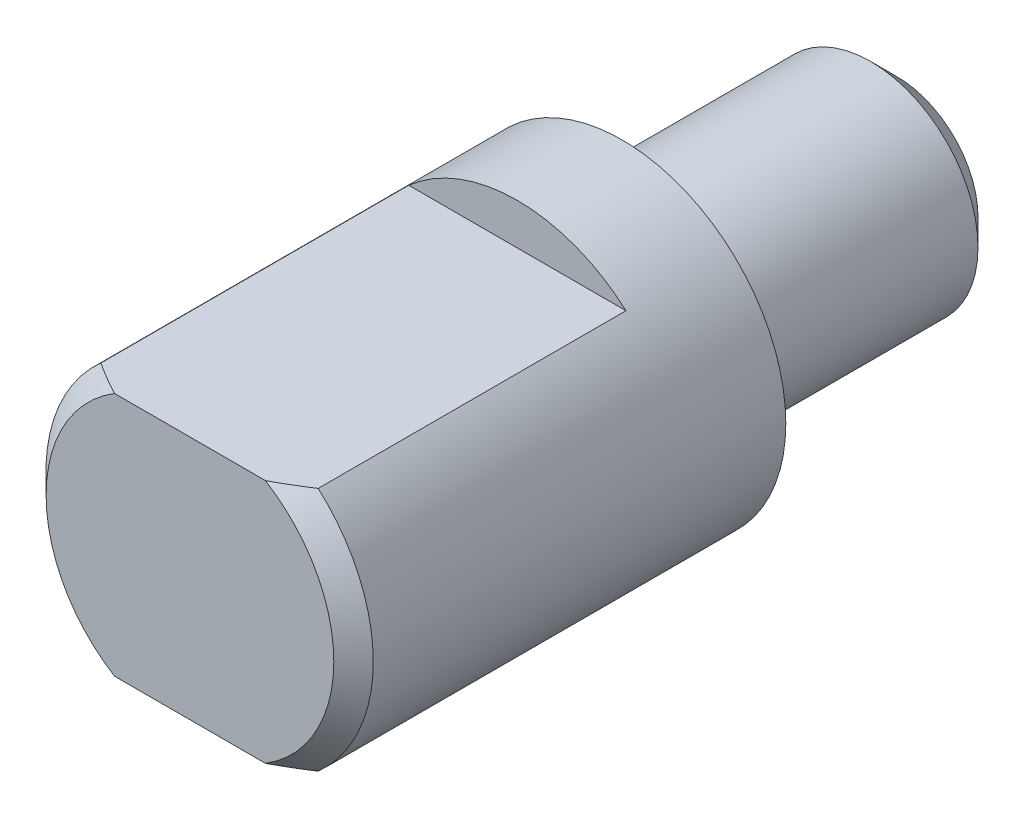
ISO-10303-21;
HEADER;
FILE_DESCRIPTION(('STEP AP214'),'2;1');
FILE_NAME('part.step','',(''),(''),'','','');
FILE_SCHEMA(('AUTOMOTIVE_DESIGN { 1 0 10303 214 1 1 1 1 }'));
ENDSEC;
DATA;
#1=APPLICATION_CONTEXT('core data for automotive mechanical design processes');
#2=APPLICATION_PROTOCOL_DEFINITION('international standard','automotive_design',2000,#1);
#3=PRODUCT_CONTEXT('',#1,'mechanical');
#4=PRODUCT('Part','Part','',(#3));
#5=PRODUCT_RELATED_PRODUCT_CATEGORY('part','',(#4));
#6=PRODUCT_DEFINITION_FORMATION('','',#4);
#7=PRODUCT_DEFINITION_CONTEXT('part definition',#1,'design');
#8=PRODUCT_DEFINITION('design','',#6,#7);
#9=PRODUCT_DEFINITION_SHAPE('','',#8);
#10=(LENGTH_UNIT() NAMED_UNIT(*) SI_UNIT(.MILLI.,.METRE.));
#11=(NAMED_UNIT(*) PLANE_ANGLE_UNIT() SI_UNIT($,.RADIAN.));
#12=(NAMED_UNIT(*) SI_UNIT($,.STERADIAN.) SOLID_ANGLE_UNIT());
#13=UNCERTAINTY_MEASURE_WITH_UNIT(LENGTH_MEASURE(1.E-05),#10,'distance_accuracy_value','');
#14=(GEOMETRIC_REPRESENTATION_CONTEXT(3) GLOBAL_UNCERTAINTY_ASSIGNED_CONTEXT((#13)) GLOBAL_UNIT_ASSIGNED_CONTEXT((#10,
#11,#12)) REPRESENTATION_CONTEXT('',''));
#15=CARTESIAN_POINT('',(0.,0.,0.));
#16=DIRECTION('',(0.,0.,1.));
#17=DIRECTION('',(1.,0.,0.));
#18=AXIS2_PLACEMENT_3D('',#15,#16,#17);
#19=CARTESIAN_POINT('',(0.,0.,3.684));
#20=DIRECTION('',(0.,0.,-1.));
#21=DIRECTION('',(-1.,0.,0.));
#22=AXIS2_PLACEMENT_3D('',#19,#20,#21);
#23=CONICAL_SURFACE('',#22,3.175,0.791934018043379);
#24=CARTESIAN_POINT('',(0.,0.,3.684));
#25=DIRECTION('',(0.,0.,1.));
#26=DIRECTION('',(1.,0.,0.));
#27=AXIS2_PLACEMENT_3D('',#24,#25,#26);
#28=CIRCLE('',#27,3.175);
#29=CARTESIAN_POINT('',(-2.10713075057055,2.375,3.684));
#30=VERTEX_POINT('',#29);
#31=CARTESIAN_POINT('',(-2.10713075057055,-2.375,3.684));
#32=VERTEX_POINT('',#31);
#33=EDGE_CURVE('E105',#30,#32,#28,.T.);
#34=ORIENTED_EDGE('',*,*,#33,.T.);
#35=CARTESIAN_POINT('',(-6.62966945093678,-2.375,-0.13301595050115));
#36=CARTESIAN_POINT('',(-6.41872085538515,-2.375,0.0629362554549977));
#37=CARTESIAN_POINT('',(-6.20729327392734,-2.375,0.258380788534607));
#38=CARTESIAN_POINT('',(-5.78286017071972,-2.375,0.64788739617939));
#39=CARTESIAN_POINT('',(-5.56985352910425,-2.375,0.841948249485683));
#40=CARTESIAN_POINT('',(-5.13574053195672,-2.375,1.23363349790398));
#41=CARTESIAN_POINT('',(-4.9145790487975,-2.375,1.43119690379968));
#42=CARTESIAN_POINT('',(-4.46963283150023,-2.375,1.82304516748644));
#43=CARTESIAN_POINT('',(-4.24585006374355,-2.375,2.01733224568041));
#44=CARTESIAN_POINT('',(-3.90719638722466,-2.375,2.30510248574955));
#45=CARTESIAN_POINT('',(-3.79385459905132,-2.375,2.40038380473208));
#46=CARTESIAN_POINT('',(-3.56590809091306,-2.375,2.5894215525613));
#47=CARTESIAN_POINT('',(-3.4513034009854,-2.375,2.68317801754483));
#48=CARTESIAN_POINT('',(-3.22025369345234,-2.375,2.86895465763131));
#49=CARTESIAN_POINT('',(-3.10380502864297,-2.375,2.96097030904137));
#50=CARTESIAN_POINT('',(-2.8689222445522,-2.375,3.14241965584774));
#51=CARTESIAN_POINT('',(-2.75048831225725,-2.375,3.23185359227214));
#52=CARTESIAN_POINT('',(-2.51255729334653,-2.375,3.40617108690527));
#53=CARTESIAN_POINT('',(-2.3930916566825,-2.375,3.49109735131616));
#54=CARTESIAN_POINT('',(-2.1509050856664,-2.375,3.65634247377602));
#55=CARTESIAN_POINT('',(-2.02818269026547,-2.375,3.73665921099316));
#56=CARTESIAN_POINT('',(-1.77912466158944,-2.375,3.89039659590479));
#57=CARTESIAN_POINT('',(-1.65280524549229,-2.375,3.96384327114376));
#58=CARTESIAN_POINT('',(-1.39512518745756,-2.375,4.10119391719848));
#59=CARTESIAN_POINT('',(-1.26377071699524,-2.375,4.16510912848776));
#60=CARTESIAN_POINT('',(-1.05701971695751,-2.375,4.25273595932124));
#61=CARTESIAN_POINT('',(-0.983728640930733,-2.375,4.28140199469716));
#62=CARTESIAN_POINT('',(-0.83535687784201,-2.375,4.3337772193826));
#63=CARTESIAN_POINT('',(-0.760275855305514,-2.375,4.35748547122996));
#64=CARTESIAN_POINT('',(-0.608898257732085,-2.375,4.39885359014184));
#65=CARTESIAN_POINT('',(-0.532610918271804,-2.375,4.41654679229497));
#66=CARTESIAN_POINT('',(-0.378780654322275,-2.375,4.445154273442));
#67=CARTESIAN_POINT('',(-0.301238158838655,-2.375,4.45607082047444));
#68=CARTESIAN_POINT('',(-0.144559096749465,-2.375,4.47054748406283));
#69=CARTESIAN_POINT('',(-0.0654144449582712,-2.375,4.47402190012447));
#70=CARTESIAN_POINT('',(0.0928249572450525,-2.375,4.47312081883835));
#71=CARTESIAN_POINT('',(0.171919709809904,-2.375,4.4687456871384));
#72=CARTESIAN_POINT('',(0.329626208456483,-2.375,4.45241265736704));
#73=CARTESIAN_POINT('',(0.408234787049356,-2.375,4.44042470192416));
#74=CARTESIAN_POINT('',(0.56408615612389,-2.375,4.40957980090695));
#75=CARTESIAN_POINT('',(0.641328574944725,-2.375,4.39072101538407));
#76=CARTESIAN_POINT('',(0.827865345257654,-2.375,4.33746225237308));
#77=CARTESIAN_POINT('',(0.936246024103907,-2.375,4.29987709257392));
#78=CARTESIAN_POINT('',(1.14927492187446,-2.375,4.21535984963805));
#79=CARTESIAN_POINT('',(1.25392057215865,-2.375,4.16842147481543));
#80=CARTESIAN_POINT('',(1.46087103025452,-2.375,4.06709514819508));
#81=CARTESIAN_POINT('',(1.56313950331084,-2.375,4.01263383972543));
#82=CARTESIAN_POINT('',(1.71427099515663,-2.375,3.92703840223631));
#83=CARTESIAN_POINT('',(1.76426245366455,-2.375,3.89786057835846));
#84=CARTESIAN_POINT('',(1.86356372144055,-2.375,3.83837009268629));
#85=CARTESIAN_POINT('',(1.91287355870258,-2.375,3.80805747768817));
#86=CARTESIAN_POINT('',(2.07522042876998,-2.375,3.70601224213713));
#87=CARTESIAN_POINT('',(2.18692206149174,-2.375,3.63215349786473));
#88=CARTESIAN_POINT('',(2.40772318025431,-2.375,3.48062951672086));
#89=CARTESIAN_POINT('',(2.5168220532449,-2.375,3.40296339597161));
#90=CARTESIAN_POINT('',(2.73301390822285,-2.375,3.24473477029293));
#91=CARTESIAN_POINT('',(2.84010537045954,-2.375,3.16417019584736));
#92=CARTESIAN_POINT('',(3.05261723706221,-2.375,3.00086187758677));
#93=CARTESIAN_POINT('',(3.15803753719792,-2.375,2.9181179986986));
#94=CARTESIAN_POINT('',(3.47300086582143,-2.375,2.6667998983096));
#95=CARTESIAN_POINT('',(3.68051445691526,-2.375,2.49568568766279));
#96=CARTESIAN_POINT('',(4.09182405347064,-2.375,2.14926116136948));
#97=CARTESIAN_POINT('',(4.29562161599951,-2.375,1.97395267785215));
#98=CARTESIAN_POINT('',(4.67931232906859,-2.375,1.63905531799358));
#99=CARTESIAN_POINT('',(4.85946034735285,-2.375,1.47975783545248));
#100=CARTESIAN_POINT('',(5.21824582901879,-2.375,1.15942835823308));
#101=CARTESIAN_POINT('',(5.39688309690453,-2.375,0.998396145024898));
#102=CARTESIAN_POINT('',(5.75173692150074,-2.375,0.676174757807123));
#103=CARTESIAN_POINT('',(5.92796166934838,-2.375,0.514994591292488));
#104=CARTESIAN_POINT('',(6.27946145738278,-2.375,0.191659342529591));
#105=CARTESIAN_POINT('',(6.45473664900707,-2.375,0.0295044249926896));
#106=CARTESIAN_POINT('',(6.62966945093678,-2.375,-0.13301595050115));
#107=B_SPLINE_CURVE_WITH_KNOTS('',3,(#35,#36,#37,#38,#39,#40,#41,#42,#43,#44,#45,#46,#47,#48,
#49,#50,#51,#52,#53,#54,#55,#56,#57,#58,#59,#60,#61,#62,#63,#64,#65,#66,#67,#68,#69,#70,#71,#72,
#73,#74,#75,#76,#77,#78,#79,#80,#81,#82,#83,#84,#85,#86,#87,#88,#89,#90,#91,#92,#93,#94,#95,#96,
#97,#98,#99,#100,#101,#102,#103,#104,#105,#106),.UNSPECIFIED.,.F.,.F.,(4,2,2,2,2,2,2,2,2,2,2,2,
2,2,2,2,2,2,2,2,2,2,2,2,2,2,2,2,2,2,2,2,2,2,2,4),(0.,0.863760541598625,1.72820709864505,
2.61784876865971,3.50686109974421,3.95106286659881,4.39525409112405,4.84047397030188,
5.28565214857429,5.72530383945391,6.16515621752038,6.60326828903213,7.04085953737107,
7.2768120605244,7.51280915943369,7.74747620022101,7.98206465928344,8.21934033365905,
8.45660495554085,8.69481223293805,8.93308334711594,9.27660606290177,9.62036064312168,
9.96774119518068,10.1413805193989,10.3150126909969,10.7166254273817,11.1183318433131,
11.5203310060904,11.9223551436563,12.7291420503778,13.5355827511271,14.2569976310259,
14.9785044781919,15.6949553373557,16.4112883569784),.UNSPECIFIED.);
#108=CARTESIAN_POINT('',(-1.46406113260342,-2.375,4.064));
#109=VERTEX_POINT('',#108);
#110=EDGE_CURVE('E128',#32,#109,#107,.T.);
#111=ORIENTED_EDGE('',*,*,#110,.T.);
#112=CARTESIAN_POINT('',(0.,0.,4.064));
#113=DIRECTION('',(0.,0.,1.));
#114=DIRECTION('',(1.,0.,0.));
#115=AXIS2_PLACEMENT_3D('',#112,#113,#114);
#116=CIRCLE('',#115,2.79);
#117=CARTESIAN_POINT('',(-1.46406113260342,2.375,4.064));
#118=VERTEX_POINT('',#117);
#119=EDGE_CURVE('E115',#118,#109,#116,.T.);
#120=ORIENTED_EDGE('',*,*,#119,.F.);
#121=CARTESIAN_POINT('',(6.62966945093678,2.375,-0.13301595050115));
#122=CARTESIAN_POINT('',(6.41872085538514,2.375,0.0629362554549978));
#123=CARTESIAN_POINT('',(6.20729327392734,2.375,0.258380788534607));
#124=CARTESIAN_POINT('',(5.78286017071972,2.375,0.64788739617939));
#125=CARTESIAN_POINT('',(5.56985352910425,2.375,0.841948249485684));
#126=CARTESIAN_POINT('',(5.13574053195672,2.375,1.23363349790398));
#127=CARTESIAN_POINT('',(4.9145790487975,2.375,1.43119690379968));
#128=CARTESIAN_POINT('',(4.46963283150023,2.375,1.82304516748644));
#129=CARTESIAN_POINT('',(4.24585006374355,2.375,2.01733224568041));
#130=CARTESIAN_POINT('',(3.90719638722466,2.375,2.30510248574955));
#131=CARTESIAN_POINT('',(3.79385459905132,2.375,2.40038380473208));
#132=CARTESIAN_POINT('',(3.56590809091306,2.375,2.5894215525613));
#133=CARTESIAN_POINT('',(3.4513034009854,2.375,2.68317801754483));
#134=CARTESIAN_POINT('',(3.22025369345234,2.375,2.86895465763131));
#135=CARTESIAN_POINT('',(3.10380502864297,2.375,2.96097030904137));
#136=CARTESIAN_POINT('',(2.8689222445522,2.375,3.14241965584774));
#137=CARTESIAN_POINT('',(2.75048831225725,2.375,3.23185359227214));
#138=CARTESIAN_POINT('',(2.51255729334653,2.375,3.40617108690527));
#139=CARTESIAN_POINT('',(2.3930916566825,2.375,3.49109735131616));
#140=CARTESIAN_POINT('',(2.1509050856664,2.375,3.65634247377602));
#141=CARTESIAN_POINT('',(2.02818269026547,2.375,3.73665921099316));
#142=CARTESIAN_POINT('',(1.77912466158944,2.375,3.89039659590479));
#143=CARTESIAN_POINT('',(1.65280524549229,2.375,3.96384327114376));
#144=CARTESIAN_POINT('',(1.39512518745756,2.375,4.10119391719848));
#145=CARTESIAN_POINT('',(1.26377071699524,2.375,4.16510912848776));
#146=CARTESIAN_POINT('',(1.05701971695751,2.375,4.25273595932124));
#147=CARTESIAN_POINT('',(0.983728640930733,2.375,4.28140199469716));
#148=CARTESIAN_POINT('',(0.83535687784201,2.375,4.3337772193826));
#149=CARTESIAN_POINT('',(0.760275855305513,2.375,4.35748547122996));
#150=CARTESIAN_POINT('',(0.608898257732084,2.375,4.39885359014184));
#151=CARTESIAN_POINT('',(0.532610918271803,2.375,4.41654679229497));
#152=CARTESIAN_POINT('',(0.378780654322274,2.375,4.445154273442));
#153=CARTESIAN_POINT('',(0.301238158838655,2.375,4.45607082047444));
#154=CARTESIAN_POINT('',(0.144559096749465,2.375,4.47054748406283));
#155=CARTESIAN_POINT('',(0.0654144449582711,2.375,4.47402190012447));
#156=CARTESIAN_POINT('',(-0.0928249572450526,2.375,4.47312081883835));
#157=CARTESIAN_POINT('',(-0.171919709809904,2.375,4.4687456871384));
#158=CARTESIAN_POINT('',(-0.329626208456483,2.375,4.45241265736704));
#159=CARTESIAN_POINT('',(-0.408234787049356,2.375,4.44042470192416));
#160=CARTESIAN_POINT('',(-0.56408615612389,2.375,4.40957980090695));
#161=CARTESIAN_POINT('',(-0.641328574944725,2.375,4.39072101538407));
#162=CARTESIAN_POINT('',(-0.827865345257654,2.375,4.33746225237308));
#163=CARTESIAN_POINT('',(-0.936246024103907,2.375,4.29987709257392));
#164=CARTESIAN_POINT('',(-1.14927492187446,2.375,4.21535984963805));
#165=CARTESIAN_POINT('',(-1.25392057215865,2.375,4.16842147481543));
#166=CARTESIAN_POINT('',(-1.46087103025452,2.375,4.06709514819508));
#167=CARTESIAN_POINT('',(-1.56313950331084,2.375,4.01263383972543));
#168=CARTESIAN_POINT('',(-1.71427099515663,2.375,3.92703840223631));
#169=CARTESIAN_POINT('',(-1.76426245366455,2.375,3.89786057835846));
#170=CARTESIAN_POINT('',(-1.86356372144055,2.375,3.83837009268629));
#171=CARTESIAN_POINT('',(-1.91287355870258,2.375,3.80805747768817));
#172=CARTESIAN_POINT('',(-2.07522042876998,2.375,3.70601224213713));
#173=CARTESIAN_POINT('',(-2.18692206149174,2.375,3.63215349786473));
#174=CARTESIAN_POINT('',(-2.40772318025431,2.375,3.48062951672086));
#175=CARTESIAN_POINT('',(-2.51682205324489,2.375,3.40296339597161));
#176=CARTESIAN_POINT('',(-2.73301390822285,2.375,3.24473477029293));
#177=CARTESIAN_POINT('',(-2.84010537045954,2.375,3.16417019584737));
#178=CARTESIAN_POINT('',(-3.05261723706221,2.375,3.00086187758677));
#179=CARTESIAN_POINT('',(-3.15803753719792,2.375,2.91811799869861));
#180=CARTESIAN_POINT('',(-3.47300086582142,2.375,2.66679989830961));
#181=CARTESIAN_POINT('',(-3.68051445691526,2.375,2.49568568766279));
#182=CARTESIAN_POINT('',(-4.09182405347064,2.375,2.14926116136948));
#183=CARTESIAN_POINT('',(-4.29562161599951,2.375,1.97395267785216));
#184=CARTESIAN_POINT('',(-4.67931232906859,2.375,1.63905531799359));
#185=CARTESIAN_POINT('',(-4.85946034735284,2.375,1.47975783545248));
#186=CARTESIAN_POINT('',(-5.21824582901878,2.375,1.15942835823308));
#187=CARTESIAN_POINT('',(-5.39688309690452,2.375,0.998396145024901));
#188=CARTESIAN_POINT('',(-5.75173692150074,2.375,0.676174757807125));
#189=CARTESIAN_POINT('',(-5.92796166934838,2.375,0.514994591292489));
#190=CARTESIAN_POINT('',(-6.27946145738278,2.375,0.191659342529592));
#191=CARTESIAN_POINT('',(-6.45473664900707,2.375,0.0295044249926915));
#192=CARTESIAN_POINT('',(-6.62966945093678,2.375,-0.13301595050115));
#193=B_SPLINE_CURVE_WITH_KNOTS('',3,(#121,#122,#123,#124,#125,#126,#127,#128,#129,#130,#131,
#132,#133,#134,#135,#136,#137,#138,#139,#140,#141,#142,#143,#144,#145,#146,#147,#148,#149,#150,
#151,#152,#153,#154,#155,#156,#157,#158,#159,#160,#161,#162,#163,#164,#165,#166,#167,#168,#169,
#170,#171,#172,#173,#174,#175,#176,#177,#178,#179,#180,#181,#182,#183,#184,#185,#186,#187,#188,
#189,#190,#191,#192),.UNSPECIFIED.,.F.,.F.,(4,2,2,2,2,2,2,2,2,2,2,2,2,2,2,2,2,2,2,2,2,2,2,2,2,2,
2,2,2,2,2,2,2,2,2,4),(0.,0.863760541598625,1.72820709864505,2.61784876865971,3.50686109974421,
3.95106286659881,4.39525409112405,4.84047397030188,5.28565214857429,5.72530383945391,
6.16515621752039,6.60326828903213,7.04085953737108,7.2768120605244,7.51280915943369,
7.74747620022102,7.98206465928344,8.21934033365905,8.45660495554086,8.69481223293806,
8.93308334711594,9.27660606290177,9.62036064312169,9.96774119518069,10.1413805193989,
10.3150126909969,10.7166254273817,11.1183318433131,11.5203310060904,11.9223551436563,
12.7291420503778,13.5355827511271,14.2569976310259,14.9785044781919,15.6949553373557,
16.4112883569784),.UNSPECIFIED.);
#194=EDGE_CURVE('E129',#118,#30,#193,.T.);
#195=ORIENTED_EDGE('',*,*,#194,.T.);
#196=EDGE_LOOP('',(#34,#111,#120,#195));
#197=FACE_BOUND('',#196,.T.);
#198=ADVANCED_FACE('F33',(#197),#23,.T.);
#199=CARTESIAN_POINT('',(0.,0.,4.064));
#200=DIRECTION('',(0.,0.,-1.));
#201=DIRECTION('',(-1.,0.,0.));
#202=AXIS2_PLACEMENT_3D('',#199,#200,#201);
#203=PLANE('',#202);
#204=ORIENTED_EDGE('',*,*,#119,.T.);
#205=DIRECTION('',(1.,0.,0.));
#206=VECTOR('',#205,1.);
#207=CARTESIAN_POINT('',(-5.,-2.375,4.064));
#208=LINE('',#207,#206);
#209=CARTESIAN_POINT('',(1.46406113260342,-2.375,4.064));
#210=VERTEX_POINT('',#209);
#211=EDGE_CURVE('E95',#109,#210,#208,.T.);
#212=ORIENTED_EDGE('',*,*,#211,.T.);
#213=CARTESIAN_POINT('',(1.46406113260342,2.375,4.064));
#214=VERTEX_POINT('',#213);
#215=EDGE_CURVE('E109',#210,#214,#116,.T.);
#216=ORIENTED_EDGE('',*,*,#215,.T.);
#217=DIRECTION('',(1.,0.,0.));
#218=VECTOR('',#217,1.);
#219=CARTESIAN_POINT('',(-5.,2.375,4.064));
#220=LINE('',#219,#218);
#221=EDGE_CURVE('E135',#118,#214,#220,.T.);
#222=ORIENTED_EDGE('',*,*,#221,.F.);
#223=EDGE_LOOP('',(#204,#212,#216,#222));
#224=FACE_BOUND('',#223,.T.);
#225=ADVANCED_FACE('F35',(#224),#203,.F.);
#226=ORIENTED_EDGE('',*,*,#215,.F.);
#227=CARTESIAN_POINT('',(2.10713075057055,-2.375,3.684));
#228=VERTEX_POINT('',#227);
#229=EDGE_CURVE('E94',#210,#228,#107,.T.);
#230=ORIENTED_EDGE('',*,*,#229,.T.);
#231=CARTESIAN_POINT('',(2.10713075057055,2.375,3.684));
#232=VERTEX_POINT('',#231);
#233=EDGE_CURVE('E101',#228,#232,#28,.T.);
#234=ORIENTED_EDGE('',*,*,#233,.T.);
#235=EDGE_CURVE('E132',#232,#214,#193,.T.);
#236=ORIENTED_EDGE('',*,*,#235,.T.);
#237=EDGE_LOOP('',(#226,#230,#234,#236));
#238=FACE_BOUND('',#237,.T.);
#239=ADVANCED_FACE('F144',(#238),#23,.T.);
#240=CARTESIAN_POINT('',(0.,0.,4.064));
#241=DIRECTION('',(0.,0.,1.));
#242=DIRECTION('',(1.,0.,0.));
#243=AXIS2_PLACEMENT_3D('',#240,#241,#242);
#244=CYLINDRICAL_SURFACE('',#243,3.175);
#245=ORIENTED_EDGE('',*,*,#233,.F.);
#246=DIRECTION('',(0.,0.,1.));
#247=VECTOR('',#246,1.);
#248=CARTESIAN_POINT('',(2.10713075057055,-2.375,4.064));
#249=LINE('',#248,#247);
#250=CARTESIAN_POINT('',(2.10713075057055,-2.375,-2.286));
#251=VERTEX_POINT('',#250);
#252=EDGE_CURVE('E11',#228,#251,#249,.F.);
#253=ORIENTED_EDGE('',*,*,#252,.T.);
#254=CARTESIAN_POINT('',(0.,0.,-2.286));
#255=DIRECTION('',(0.,0.,-1.));
#256=DIRECTION('',(-1.,0.,0.));
#257=AXIS2_PLACEMENT_3D('',#254,#255,#256);
#258=CIRCLE('',#257,3.175);
#259=CARTESIAN_POINT('',(-2.10713075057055,-2.375,-2.286));
#260=VERTEX_POINT('',#259);
#261=EDGE_CURVE('E85',#251,#260,#258,.T.);
#262=ORIENTED_EDGE('',*,*,#261,.T.);
#263=DIRECTION('',(0.,0.,1.));
#264=VECTOR('',#263,1.);
#265=CARTESIAN_POINT('',(-2.10713075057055,-2.375,4.064));
#266=LINE('',#265,#264);
#267=EDGE_CURVE('E41',#260,#32,#266,.T.);
#268=ORIENTED_EDGE('',*,*,#267,.T.);
#269=ORIENTED_EDGE('',*,*,#33,.F.);
#270=DIRECTION('',(0.,0.,1.));
#271=VECTOR('',#270,1.);
#272=CARTESIAN_POINT('',(-2.10713075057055,2.375,4.064));
#273=LINE('',#272,#271);
#274=CARTESIAN_POINT('',(-2.10713075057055,2.375,-2.286));
#275=VERTEX_POINT('',#274);
#276=EDGE_CURVE('E118',#30,#275,#273,.F.);
#277=ORIENTED_EDGE('',*,*,#276,.T.);
#278=CARTESIAN_POINT('',(0.,0.,-2.286));
#279=DIRECTION('',(0.,0.,-1.));
#280=DIRECTION('',(-1.,0.,0.));
#281=AXIS2_PLACEMENT_3D('',#278,#279,#280);
#282=CIRCLE('',#281,3.175);
#283=CARTESIAN_POINT('',(2.10713075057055,2.375,-2.286));
#284=VERTEX_POINT('',#283);
#285=EDGE_CURVE('E121',#275,#284,#282,.T.);
#286=ORIENTED_EDGE('',*,*,#285,.T.);
#287=DIRECTION('',(0.,0.,1.));
#288=VECTOR('',#287,1.);
#289=CARTESIAN_POINT('',(2.10713075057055,2.375,4.064));
#290=LINE('',#289,#288);
#291=EDGE_CURVE('E89',#284,#232,#290,.T.);
#292=ORIENTED_EDGE('',*,*,#291,.T.);
#293=EDGE_LOOP('',(#245,#253,#262,#268,#269,#277,#286,#292));
#294=FACE_BOUND('',#293,.T.);
#295=CARTESIAN_POINT('',(0.,0.,-4.318));
#296=DIRECTION('',(0.,0.,1.));
#297=DIRECTION('',(1.,0.,0.));
#298=AXIS2_PLACEMENT_3D('',#295,#296,#297);
#299=CIRCLE('',#298,3.175);
#300=CARTESIAN_POINT('',(3.175,0.,-4.318));
#301=VERTEX_POINT('',#300);
#302=EDGE_CURVE('E106',#301,#301,#299,.T.);
#303=ORIENTED_EDGE('',*,*,#302,.T.);
#304=EDGE_LOOP('',(#303));
#305=FACE_BOUND('',#304,.T.);
#306=ADVANCED_FACE('F98',(#294,#305),#244,.T.);
#307=CARTESIAN_POINT('',(0.,2.0828,-4.318));
#308=DIRECTION('',(0.,0.,1.));
#309=DIRECTION('',(1.,0.,0.));
#310=AXIS2_PLACEMENT_3D('',#307,#308,#309);
#311=PLANE('',#310);
#312=ORIENTED_EDGE('',*,*,#302,.F.);
#313=EDGE_LOOP('',(#312));
#314=FACE_BOUND('',#313,.T.);
#315=CARTESIAN_POINT('',(0.,0.,-4.318));
#316=DIRECTION('',(0.,0.,1.));
#317=DIRECTION('',(1.,0.,0.));
#318=AXIS2_PLACEMENT_3D('',#315,#316,#317);
#319=CIRCLE('',#318,2.0828);
#320=CARTESIAN_POINT('',(2.0828,0.,-4.318));
#321=VERTEX_POINT('',#320);
#322=EDGE_CURVE('E111',#321,#321,#319,.T.);
#323=ORIENTED_EDGE('',*,*,#322,.T.);
#324=EDGE_LOOP('',(#323));
#325=FACE_BOUND('',#324,.T.);
#326=ADVANCED_FACE('F165',(#314,#325),#311,.F.);
#327=CARTESIAN_POINT('',(0.,0.,4.064));
#328=DIRECTION('',(0.,0.,1.));
#329=DIRECTION('',(1.,0.,0.));
#330=AXIS2_PLACEMENT_3D('',#327,#328,#329);
#331=CYLINDRICAL_SURFACE('',#330,2.0828);
#332=ORIENTED_EDGE('',*,*,#322,.F.);
#333=EDGE_LOOP('',(#332));
#334=FACE_BOUND('',#333,.T.);
#335=CARTESIAN_POINT('',(0.,0.,-9.138));
#336=DIRECTION('',(0.,0.,1.));
#337=DIRECTION('',(1.,0.,0.));
#338=AXIS2_PLACEMENT_3D('',#335,#336,#337);
#339=CIRCLE('',#338,2.0828);
#340=CARTESIAN_POINT('',(2.0828,0.,-9.138));
#341=VERTEX_POINT('',#340);
#342=EDGE_CURVE('E263',#341,#341,#339,.T.);
#343=ORIENTED_EDGE('',*,*,#342,.T.);
#344=EDGE_LOOP('',(#343));
#345=FACE_BOUND('',#344,.T.);
#346=ADVANCED_FACE('F161',(#334,#345),#331,.T.);
#347=CARTESIAN_POINT('',(0.,0.,-9.648));
#348=DIRECTION('',(0.,0.,1.));
#349=DIRECTION('',(1.,0.,0.));
#350=AXIS2_PLACEMENT_3D('',#347,#348,#349);
#351=CONICAL_SURFACE('',#350,1.57280000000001,0.785398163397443);
#352=ORIENTED_EDGE('',*,*,#342,.F.);
#353=EDGE_LOOP('',(#352));
#354=FACE_BOUND('',#353,.T.);
#355=CARTESIAN_POINT('',(0.,0.,-9.648));
#356=DIRECTION('',(0.,0.,1.));
#357=DIRECTION('',(1.,0.,0.));
#358=AXIS2_PLACEMENT_3D('',#355,#356,#357);
#359=CIRCLE('',#358,1.57280000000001);
#360=CARTESIAN_POINT('',(1.57280000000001,0.,-9.648));
#361=VERTEX_POINT('',#360);
#362=EDGE_CURVE('E134',#361,#361,#359,.T.);
#363=ORIENTED_EDGE('',*,*,#362,.T.);
#364=EDGE_LOOP('',(#363));
#365=FACE_BOUND('',#364,.T.);
#366=ADVANCED_FACE('F157',(#354,#365),#351,.T.);
#367=CARTESIAN_POINT('',(0.,0.,-9.648));
#368=DIRECTION('',(0.,0.,1.));
#369=DIRECTION('',(1.,0.,0.));
#370=AXIS2_PLACEMENT_3D('',#367,#368,#369);
#371=PLANE('',#370);
#372=ORIENTED_EDGE('',*,*,#362,.F.);
#373=EDGE_LOOP('',(#372));
#374=FACE_BOUND('',#373,.T.);
#375=ADVANCED_FACE('F154',(#374),#371,.F.);
#376=CARTESIAN_POINT('',(-5.,2.375,-2.286));
#377=DIRECTION('',(0.,0.,-1.));
#378=DIRECTION('',(-1.,0.,0.));
#379=AXIS2_PLACEMENT_3D('',#376,#377,#378);
#380=PLANE('',#379);
#381=DIRECTION('',(1.,0.,0.));
#382=VECTOR('',#381,1.);
#383=CARTESIAN_POINT('',(-5.,2.375,-2.286));
#384=LINE('',#383,#382);
#385=EDGE_CURVE('E55',#275,#284,#384,.T.);
#386=ORIENTED_EDGE('',*,*,#385,.T.);
#387=ORIENTED_EDGE('',*,*,#285,.F.);
#388=EDGE_LOOP('',(#386,#387));
#389=FACE_BOUND('',#388,.T.);
#390=ADVANCED_FACE('F152',(#389),#380,.F.);
#391=CARTESIAN_POINT('',(-5.,2.375,4.064));
#392=DIRECTION('',(0.,-1.,0.));
#393=DIRECTION('',(0.,0.,-1.));
#394=AXIS2_PLACEMENT_3D('',#391,#392,#393);
#395=PLANE('',#394);
#396=ORIENTED_EDGE('',*,*,#291,.F.);
#397=ORIENTED_EDGE('',*,*,#385,.F.);
#398=ORIENTED_EDGE('',*,*,#276,.F.);
#399=ORIENTED_EDGE('',*,*,#194,.F.);
#400=ORIENTED_EDGE('',*,*,#221,.T.);
#401=ORIENTED_EDGE('',*,*,#235,.F.);
#402=EDGE_LOOP('',(#396,#397,#398,#399,#400,#401));
#403=FACE_BOUND('',#402,.T.);
#404=ADVANCED_FACE('F147',(#403),#395,.F.);
#405=CARTESIAN_POINT('',(-5.,-2.375,4.064));
#406=DIRECTION('',(0.,1.,0.));
#407=DIRECTION('',(0.,0.,1.));
#408=AXIS2_PLACEMENT_3D('',#405,#406,#407);
#409=PLANE('',#408);
#410=ORIENTED_EDGE('',*,*,#267,.F.);
#411=DIRECTION('',(1.,0.,0.));
#412=VECTOR('',#411,1.);
#413=CARTESIAN_POINT('',(-5.,-2.375,-2.286));
#414=LINE('',#413,#412);
#415=EDGE_CURVE('E47',#260,#251,#414,.T.);
#416=ORIENTED_EDGE('',*,*,#415,.T.);
#417=ORIENTED_EDGE('',*,*,#252,.F.);
#418=ORIENTED_EDGE('',*,*,#229,.F.);
#419=ORIENTED_EDGE('',*,*,#211,.F.);
#420=ORIENTED_EDGE('',*,*,#110,.F.);
#421=EDGE_LOOP('',(#410,#416,#417,#418,#419,#420));
#422=FACE_BOUND('',#421,.T.);
#423=ADVANCED_FACE('F92',(#422),#409,.F.);
#424=CARTESIAN_POINT('',(-5.,-2.375,-2.286));
#425=DIRECTION('',(0.,0.,-1.));
#426=DIRECTION('',(-1.,0.,0.));
#427=AXIS2_PLACEMENT_3D('',#424,#425,#426);
#428=PLANE('',#427);
#429=ORIENTED_EDGE('',*,*,#415,.F.);
#430=ORIENTED_EDGE('',*,*,#261,.F.);
#431=EDGE_LOOP('',(#429,#430));
#432=FACE_BOUND('',#431,.T.);
#433=ADVANCED_FACE('F86',(#432),#428,.F.);
#434=CLOSED_SHELL('',(#198,#225,#239,#306,#326,#346,#366,#375,#390,#404,#423,#433));
#435=MANIFOLD_SOLID_BREP('B2',#434);
#436=ADVANCED_BREP_SHAPE_REPRESENTATION('',(#18,#435),#14);
#437=SHAPE_DEFINITION_REPRESENTATION(#9,#436);
ENDSEC;
END-ISO-10303-21;
